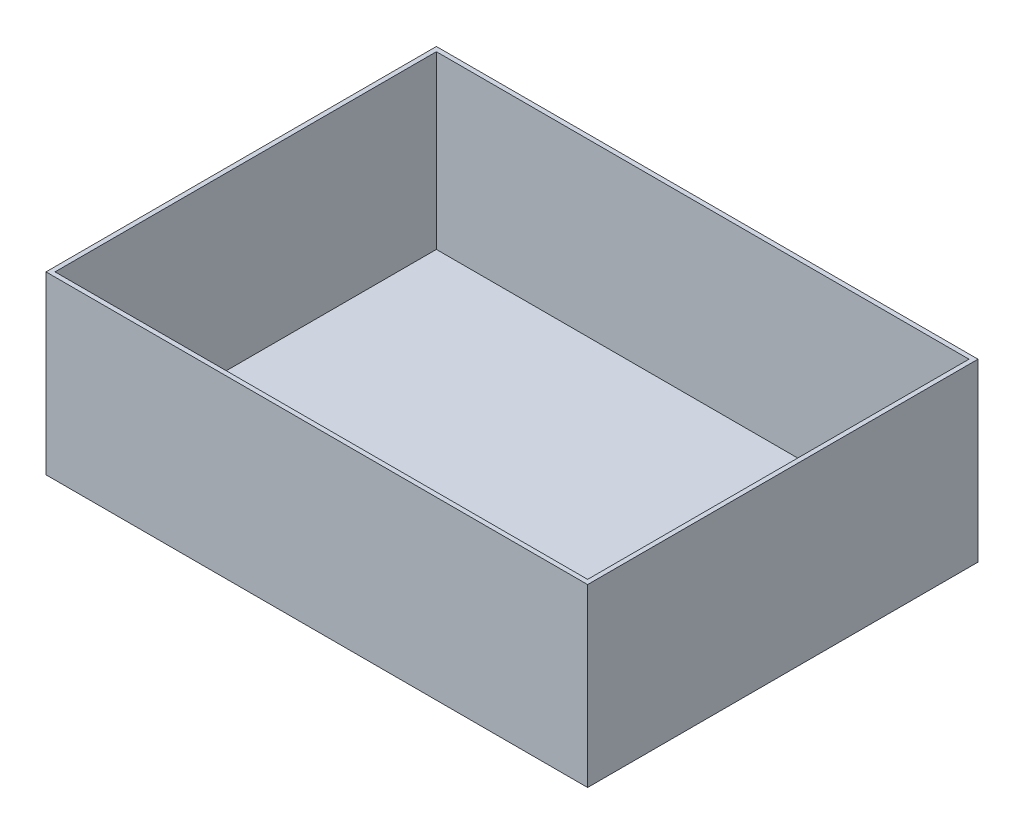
ISO-10303-21;
HEADER;
FILE_DESCRIPTION(('STEP AP214'),'2;1');
FILE_NAME('part.step','',(''),(''),'','','');
FILE_SCHEMA(('AUTOMOTIVE_DESIGN { 1 0 10303 214 1 1 1 1 }'));
ENDSEC;
DATA;
#1=APPLICATION_CONTEXT('core data for automotive mechanical design processes');
#2=APPLICATION_PROTOCOL_DEFINITION('international standard','automotive_design',2000,#1);
#3=PRODUCT_CONTEXT('',#1,'mechanical');
#4=PRODUCT('Part','Part','',(#3));
#5=PRODUCT_RELATED_PRODUCT_CATEGORY('part','',(#4));
#6=PRODUCT_DEFINITION_FORMATION('','',#4);
#7=PRODUCT_DEFINITION_CONTEXT('part definition',#1,'design');
#8=PRODUCT_DEFINITION('design','',#6,#7);
#9=PRODUCT_DEFINITION_SHAPE('','',#8);
#10=(LENGTH_UNIT() NAMED_UNIT(*) SI_UNIT(.MILLI.,.METRE.));
#11=(NAMED_UNIT(*) PLANE_ANGLE_UNIT() SI_UNIT($,.RADIAN.));
#12=(NAMED_UNIT(*) SI_UNIT($,.STERADIAN.) SOLID_ANGLE_UNIT());
#13=UNCERTAINTY_MEASURE_WITH_UNIT(LENGTH_MEASURE(1.E-05),#10,'distance_accuracy_value','');
#14=(GEOMETRIC_REPRESENTATION_CONTEXT(3) GLOBAL_UNCERTAINTY_ASSIGNED_CONTEXT((#13)) GLOBAL_UNIT_ASSIGNED_CONTEXT((#10,
#11,#12)) REPRESENTATION_CONTEXT('',''));
#15=CARTESIAN_POINT('',(0.,0.,0.));
#16=DIRECTION('',(0.,0.,1.));
#17=DIRECTION('',(1.,0.,0.));
#18=AXIS2_PLACEMENT_3D('',#15,#16,#17);
#19=CARTESIAN_POINT('',(-76.3087450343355,49.53,-55.0025096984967));
#20=DIRECTION('',(1.,0.,0.));
#21=DIRECTION('',(0.,0.,-1.));
#22=AXIS2_PLACEMENT_3D('',#19,#20,#21);
#23=PLANE('',#22);
#24=DIRECTION('',(0.,0.,1.));
#25=VECTOR('',#24,1.);
#26=CARTESIAN_POINT('',(-76.3087450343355,0.,-55.0025096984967));
#27=LINE('',#26,#25);
#28=CARTESIAN_POINT('',(-76.3087450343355,0.,-55.0025096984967));
#29=VERTEX_POINT('',#28);
#30=CARTESIAN_POINT('',(-76.3087450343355,0.,55.0025096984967));
#31=VERTEX_POINT('',#30);
#32=EDGE_CURVE('E126',#29,#31,#27,.T.);
#33=ORIENTED_EDGE('',*,*,#32,.T.);
#34=DIRECTION('',(0.,-1.,0.));
#35=VECTOR('',#34,1.);
#36=CARTESIAN_POINT('',(-76.3087450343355,49.53,55.0025096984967));
#37=LINE('',#36,#35);
#38=CARTESIAN_POINT('',(-76.3087450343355,49.53,55.0025096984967));
#39=VERTEX_POINT('',#38);
#40=EDGE_CURVE('E11',#39,#31,#37,.T.);
#41=ORIENTED_EDGE('',*,*,#40,.F.);
#42=DIRECTION('',(0.,0.,1.));
#43=VECTOR('',#42,1.);
#44=CARTESIAN_POINT('',(-76.3087450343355,49.53,-55.0025096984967));
#45=LINE('',#44,#43);
#46=CARTESIAN_POINT('',(-76.3087450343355,49.53,-55.0025096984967));
#47=VERTEX_POINT('',#46);
#48=EDGE_CURVE('E135',#47,#39,#45,.T.);
#49=ORIENTED_EDGE('',*,*,#48,.F.);
#50=DIRECTION('',(0.,-1.,0.));
#51=VECTOR('',#50,1.);
#52=CARTESIAN_POINT('',(-76.3087450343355,49.53,-55.0025096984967));
#53=LINE('',#52,#51);
#54=EDGE_CURVE('E142',#47,#29,#53,.T.);
#55=ORIENTED_EDGE('',*,*,#54,.T.);
#56=EDGE_LOOP('',(#33,#41,#49,#55));
#57=FACE_BOUND('',#56,.T.);
#58=ADVANCED_FACE('F27',(#57),#23,.F.);
#59=CARTESIAN_POINT('',(-76.3087450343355,49.53,55.0025096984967));
#60=DIRECTION('',(0.,0.,-1.));
#61=DIRECTION('',(-1.,0.,0.));
#62=AXIS2_PLACEMENT_3D('',#59,#60,#61);
#63=PLANE('',#62);
#64=DIRECTION('',(1.,0.,0.));
#65=VECTOR('',#64,1.);
#66=CARTESIAN_POINT('',(-76.3087450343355,0.,55.0025096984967));
#67=LINE('',#66,#65);
#68=CARTESIAN_POINT('',(76.3087450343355,0.,55.0025096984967));
#69=VERTEX_POINT('',#68);
#70=EDGE_CURVE('E129',#31,#69,#67,.T.);
#71=ORIENTED_EDGE('',*,*,#70,.T.);
#72=DIRECTION('',(0.,-1.,0.));
#73=VECTOR('',#72,1.);
#74=CARTESIAN_POINT('',(76.3087450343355,49.53,55.0025096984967));
#75=LINE('',#74,#73);
#76=CARTESIAN_POINT('',(76.3087450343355,49.53,55.0025096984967));
#77=VERTEX_POINT('',#76);
#78=EDGE_CURVE('E34',#77,#69,#75,.T.);
#79=ORIENTED_EDGE('',*,*,#78,.F.);
#80=DIRECTION('',(1.,0.,0.));
#81=VECTOR('',#80,1.);
#82=CARTESIAN_POINT('',(-76.3087450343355,49.53,55.0025096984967));
#83=LINE('',#82,#81);
#84=EDGE_CURVE('E137',#39,#77,#83,.T.);
#85=ORIENTED_EDGE('',*,*,#84,.F.);
#86=ORIENTED_EDGE('',*,*,#40,.T.);
#87=EDGE_LOOP('',(#71,#79,#85,#86));
#88=FACE_BOUND('',#87,.T.);
#89=ADVANCED_FACE('F165',(#88),#63,.F.);
#90=CARTESIAN_POINT('',(76.3087450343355,49.53,-55.0025096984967));
#91=DIRECTION('',(-1.,0.,0.));
#92=DIRECTION('',(0.,0.,1.));
#93=AXIS2_PLACEMENT_3D('',#90,#91,#92);
#94=PLANE('',#93);
#95=DIRECTION('',(0.,0.,-1.));
#96=VECTOR('',#95,1.);
#97=CARTESIAN_POINT('',(76.3087450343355,0.,-55.0025096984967));
#98=LINE('',#97,#96);
#99=CARTESIAN_POINT('',(76.3087450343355,0.,-55.0025096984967));
#100=VERTEX_POINT('',#99);
#101=EDGE_CURVE('E131',#69,#100,#98,.T.);
#102=ORIENTED_EDGE('',*,*,#101,.T.);
#103=DIRECTION('',(0.,-1.,0.));
#104=VECTOR('',#103,1.);
#105=CARTESIAN_POINT('',(76.3087450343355,49.53,-55.0025096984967));
#106=LINE('',#105,#104);
#107=CARTESIAN_POINT('',(76.3087450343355,49.53,-55.0025096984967));
#108=VERTEX_POINT('',#107);
#109=EDGE_CURVE('E145',#108,#100,#106,.T.);
#110=ORIENTED_EDGE('',*,*,#109,.F.);
#111=DIRECTION('',(0.,0.,-1.));
#112=VECTOR('',#111,1.);
#113=CARTESIAN_POINT('',(76.3087450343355,49.53,-55.0025096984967));
#114=LINE('',#113,#112);
#115=EDGE_CURVE('E139',#77,#108,#114,.T.);
#116=ORIENTED_EDGE('',*,*,#115,.F.);
#117=ORIENTED_EDGE('',*,*,#78,.T.);
#118=EDGE_LOOP('',(#102,#110,#116,#117));
#119=FACE_BOUND('',#118,.T.);
#120=ADVANCED_FACE('F152',(#119),#94,.F.);
#121=CARTESIAN_POINT('',(-76.3087450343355,49.53,-55.0025096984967));
#122=DIRECTION('',(0.,0.,1.));
#123=DIRECTION('',(1.,0.,0.));
#124=AXIS2_PLACEMENT_3D('',#121,#122,#123);
#125=PLANE('',#124);
#126=DIRECTION('',(-1.,0.,0.));
#127=VECTOR('',#126,1.);
#128=CARTESIAN_POINT('',(-76.3087450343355,0.,-55.0025096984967));
#129=LINE('',#128,#127);
#130=EDGE_CURVE('E133',#100,#29,#129,.T.);
#131=ORIENTED_EDGE('',*,*,#130,.T.);
#132=ORIENTED_EDGE('',*,*,#54,.F.);
#133=DIRECTION('',(-1.,0.,0.));
#134=VECTOR('',#133,1.);
#135=CARTESIAN_POINT('',(-76.3087450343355,49.53,-55.0025096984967));
#136=LINE('',#135,#134);
#137=EDGE_CURVE('E49',#108,#47,#136,.T.);
#138=ORIENTED_EDGE('',*,*,#137,.F.);
#139=ORIENTED_EDGE('',*,*,#109,.T.);
#140=EDGE_LOOP('',(#131,#132,#138,#139));
#141=FACE_BOUND('',#140,.T.);
#142=ADVANCED_FACE('F160',(#141),#125,.F.);
#143=CARTESIAN_POINT('',(-76.3087450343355,49.53,55.0025096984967));
#144=DIRECTION('',(0.,1.,0.));
#145=DIRECTION('',(0.,0.,1.));
#146=AXIS2_PLACEMENT_3D('',#143,#144,#145);
#147=PLANE('',#146);
#148=DIRECTION('',(0.,0.,1.));
#149=VECTOR('',#148,1.);
#150=CARTESIAN_POINT('',(-75.0387450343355,49.53,-55.0025096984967));
#151=LINE('',#150,#149);
#152=CARTESIAN_POINT('',(-75.0387450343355,49.53,-53.7325096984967));
#153=VERTEX_POINT('',#152);
#154=CARTESIAN_POINT('',(-75.0387450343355,49.53,53.7325096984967));
#155=VERTEX_POINT('',#154);
#156=EDGE_CURVE('E115',#153,#155,#151,.T.);
#157=ORIENTED_EDGE('',*,*,#156,.F.);
#158=DIRECTION('',(-1.,0.,0.));
#159=VECTOR('',#158,1.);
#160=CARTESIAN_POINT('',(-76.3087450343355,49.53,-53.7325096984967));
#161=LINE('',#160,#159);
#162=CARTESIAN_POINT('',(75.0387450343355,49.53,-53.7325096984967));
#163=VERTEX_POINT('',#162);
#164=EDGE_CURVE('E124',#163,#153,#161,.T.);
#165=ORIENTED_EDGE('',*,*,#164,.F.);
#166=DIRECTION('',(0.,0.,-1.));
#167=VECTOR('',#166,1.);
#168=CARTESIAN_POINT('',(75.0387450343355,49.53,-55.0025096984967));
#169=LINE('',#168,#167);
#170=CARTESIAN_POINT('',(75.0387450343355,49.53,53.7325096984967));
#171=VERTEX_POINT('',#170);
#172=EDGE_CURVE('E122',#171,#163,#169,.T.);
#173=ORIENTED_EDGE('',*,*,#172,.F.);
#174=DIRECTION('',(1.,0.,0.));
#175=VECTOR('',#174,1.);
#176=CARTESIAN_POINT('',(-76.3087450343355,49.53,53.7325096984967));
#177=LINE('',#176,#175);
#178=EDGE_CURVE('E107',#155,#171,#177,.T.);
#179=ORIENTED_EDGE('',*,*,#178,.F.);
#180=EDGE_LOOP('',(#157,#165,#173,#179));
#181=FACE_BOUND('',#180,.T.);
#182=ORIENTED_EDGE('',*,*,#48,.T.);
#183=ORIENTED_EDGE('',*,*,#84,.T.);
#184=ORIENTED_EDGE('',*,*,#115,.T.);
#185=ORIENTED_EDGE('',*,*,#137,.T.);
#186=EDGE_LOOP('',(#182,#183,#184,#185));
#187=FACE_BOUND('',#186,.T.);
#188=ADVANCED_FACE('F164',(#181,#187),#147,.T.);
#189=CARTESIAN_POINT('',(-76.3087450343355,0.,55.0025096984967));
#190=DIRECTION('',(0.,1.,0.));
#191=DIRECTION('',(0.,0.,1.));
#192=AXIS2_PLACEMENT_3D('',#189,#190,#191);
#193=PLANE('',#192);
#194=ORIENTED_EDGE('',*,*,#32,.F.);
#195=ORIENTED_EDGE('',*,*,#130,.F.);
#196=ORIENTED_EDGE('',*,*,#101,.F.);
#197=ORIENTED_EDGE('',*,*,#70,.F.);
#198=EDGE_LOOP('',(#194,#195,#196,#197));
#199=FACE_BOUND('',#198,.T.);
#200=ADVANCED_FACE('F158',(#199),#193,.F.);
#201=CARTESIAN_POINT('',(-75.0387450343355,49.53,-55.0025096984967));
#202=DIRECTION('',(1.,0.,0.));
#203=DIRECTION('',(0.,0.,-1.));
#204=AXIS2_PLACEMENT_3D('',#201,#202,#203);
#205=PLANE('',#204);
#206=DIRECTION('',(0.,0.,1.));
#207=VECTOR('',#206,1.);
#208=CARTESIAN_POINT('',(-75.0387450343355,1.27,-55.0025096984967));
#209=LINE('',#208,#207);
#210=CARTESIAN_POINT('',(-75.0387450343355,1.27,-53.7325096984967));
#211=VERTEX_POINT('',#210);
#212=CARTESIAN_POINT('',(-75.0387450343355,1.27,53.7325096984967));
#213=VERTEX_POINT('',#212);
#214=EDGE_CURVE('E98',#211,#213,#209,.T.);
#215=ORIENTED_EDGE('',*,*,#214,.F.);
#216=DIRECTION('',(0.,-1.,0.));
#217=VECTOR('',#216,1.);
#218=CARTESIAN_POINT('',(-75.0387450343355,49.53,-53.7325096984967));
#219=LINE('',#218,#217);
#220=EDGE_CURVE('E118',#153,#211,#219,.T.);
#221=ORIENTED_EDGE('',*,*,#220,.F.);
#222=ORIENTED_EDGE('',*,*,#156,.T.);
#223=DIRECTION('',(0.,-1.,0.));
#224=VECTOR('',#223,1.);
#225=CARTESIAN_POINT('',(-75.0387450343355,49.53,53.7325096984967));
#226=LINE('',#225,#224);
#227=EDGE_CURVE('E110',#155,#213,#226,.T.);
#228=ORIENTED_EDGE('',*,*,#227,.T.);
#229=EDGE_LOOP('',(#215,#221,#222,#228));
#230=FACE_BOUND('',#229,.T.);
#231=ADVANCED_FACE('F180',(#230),#205,.T.);
#232=CARTESIAN_POINT('',(-76.3087450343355,49.53,53.7325096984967));
#233=DIRECTION('',(0.,0.,-1.));
#234=DIRECTION('',(-1.,0.,0.));
#235=AXIS2_PLACEMENT_3D('',#232,#233,#234);
#236=PLANE('',#235);
#237=DIRECTION('',(1.,0.,0.));
#238=VECTOR('',#237,1.);
#239=CARTESIAN_POINT('',(-76.3087450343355,1.27,53.7325096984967));
#240=LINE('',#239,#238);
#241=CARTESIAN_POINT('',(75.0387450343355,1.27,53.7325096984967));
#242=VERTEX_POINT('',#241);
#243=EDGE_CURVE('E92',#213,#242,#240,.T.);
#244=ORIENTED_EDGE('',*,*,#243,.F.);
#245=ORIENTED_EDGE('',*,*,#227,.F.);
#246=ORIENTED_EDGE('',*,*,#178,.T.);
#247=DIRECTION('',(0.,-1.,0.));
#248=VECTOR('',#247,1.);
#249=CARTESIAN_POINT('',(75.0387450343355,49.53,53.7325096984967));
#250=LINE('',#249,#248);
#251=EDGE_CURVE('E104',#171,#242,#250,.T.);
#252=ORIENTED_EDGE('',*,*,#251,.T.);
#253=EDGE_LOOP('',(#244,#245,#246,#252));
#254=FACE_BOUND('',#253,.T.);
#255=ADVANCED_FACE('F105',(#254),#236,.T.);
#256=CARTESIAN_POINT('',(75.0387450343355,49.53,-55.0025096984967));
#257=DIRECTION('',(-1.,0.,0.));
#258=DIRECTION('',(0.,0.,1.));
#259=AXIS2_PLACEMENT_3D('',#256,#257,#258);
#260=PLANE('',#259);
#261=DIRECTION('',(0.,0.,-1.));
#262=VECTOR('',#261,1.);
#263=CARTESIAN_POINT('',(75.0387450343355,1.27,-55.0025096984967));
#264=LINE('',#263,#262);
#265=CARTESIAN_POINT('',(75.0387450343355,1.27,-53.7325096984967));
#266=VERTEX_POINT('',#265);
#267=EDGE_CURVE('E96',#242,#266,#264,.T.);
#268=ORIENTED_EDGE('',*,*,#267,.F.);
#269=ORIENTED_EDGE('',*,*,#251,.F.);
#270=ORIENTED_EDGE('',*,*,#172,.T.);
#271=DIRECTION('',(0.,-1.,0.));
#272=VECTOR('',#271,1.);
#273=CARTESIAN_POINT('',(75.0387450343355,49.53,-53.7325096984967));
#274=LINE('',#273,#272);
#275=EDGE_CURVE('E41',#163,#266,#274,.T.);
#276=ORIENTED_EDGE('',*,*,#275,.T.);
#277=EDGE_LOOP('',(#268,#269,#270,#276));
#278=FACE_BOUND('',#277,.T.);
#279=ADVANCED_FACE('F112',(#278),#260,.T.);
#280=CARTESIAN_POINT('',(-76.3087450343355,49.53,-53.7325096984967));
#281=DIRECTION('',(0.,0.,1.));
#282=DIRECTION('',(1.,0.,0.));
#283=AXIS2_PLACEMENT_3D('',#280,#281,#282);
#284=PLANE('',#283);
#285=DIRECTION('',(-1.,0.,0.));
#286=VECTOR('',#285,1.);
#287=CARTESIAN_POINT('',(-76.3087450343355,1.27,-53.7325096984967));
#288=LINE('',#287,#286);
#289=EDGE_CURVE('E113',#266,#211,#288,.T.);
#290=ORIENTED_EDGE('',*,*,#289,.F.);
#291=ORIENTED_EDGE('',*,*,#275,.F.);
#292=ORIENTED_EDGE('',*,*,#164,.T.);
#293=ORIENTED_EDGE('',*,*,#220,.T.);
#294=EDGE_LOOP('',(#290,#291,#292,#293));
#295=FACE_BOUND('',#294,.T.);
#296=ADVANCED_FACE('F183',(#295),#284,.T.);
#297=CARTESIAN_POINT('',(-76.3087450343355,1.27,55.0025096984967));
#298=DIRECTION('',(0.,1.,0.));
#299=DIRECTION('',(0.,0.,1.));
#300=AXIS2_PLACEMENT_3D('',#297,#298,#299);
#301=PLANE('',#300);
#302=ORIENTED_EDGE('',*,*,#214,.T.);
#303=ORIENTED_EDGE('',*,*,#243,.T.);
#304=ORIENTED_EDGE('',*,*,#267,.T.);
#305=ORIENTED_EDGE('',*,*,#289,.T.);
#306=EDGE_LOOP('',(#302,#303,#304,#305));
#307=FACE_BOUND('',#306,.T.);
#308=ADVANCED_FACE('F94',(#307),#301,.T.);
#309=CLOSED_SHELL('',(#58,#89,#120,#142,#188,#200,#231,#255,#279,#296,#308));
#310=MANIFOLD_SOLID_BREP('B2',#309);
#311=ADVANCED_BREP_SHAPE_REPRESENTATION('',(#18,#310),#14);
#312=SHAPE_DEFINITION_REPRESENTATION(#9,#311);
ENDSEC;
END-ISO-10303-21;
